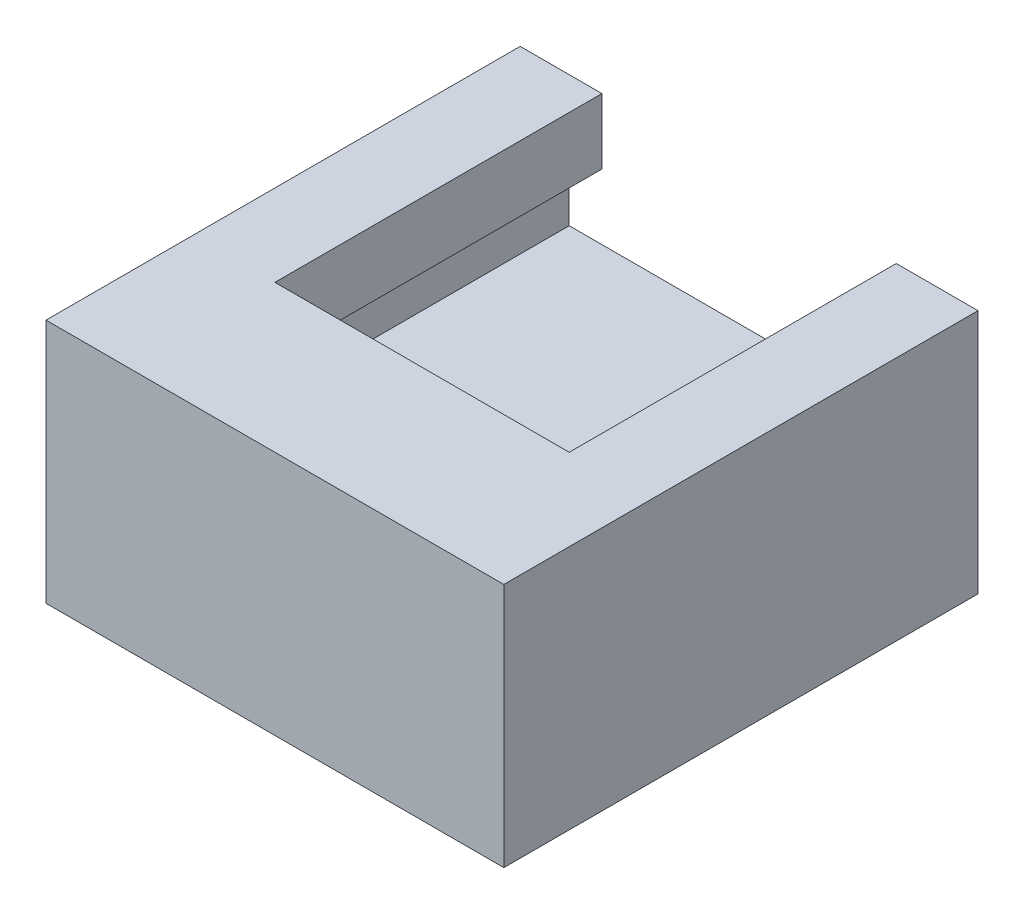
ISO-10303-21;
HEADER;
FILE_DESCRIPTION(('STEP AP214'),'2;1');
FILE_NAME('part.step','',(''),(''),'','','');
FILE_SCHEMA(('AUTOMOTIVE_DESIGN { 1 0 10303 214 1 1 1 1 }'));
ENDSEC;
DATA;
#1=APPLICATION_CONTEXT('core data for automotive mechanical design processes');
#2=APPLICATION_PROTOCOL_DEFINITION('international standard','automotive_design',2000,#1);
#3=PRODUCT_CONTEXT('',#1,'mechanical');
#4=PRODUCT('Part','Part','',(#3));
#5=PRODUCT_RELATED_PRODUCT_CATEGORY('part','',(#4));
#6=PRODUCT_DEFINITION_FORMATION('','',#4);
#7=PRODUCT_DEFINITION_CONTEXT('part definition',#1,'design');
#8=PRODUCT_DEFINITION('design','',#6,#7);
#9=PRODUCT_DEFINITION_SHAPE('','',#8);
#10=(LENGTH_UNIT() NAMED_UNIT(*) SI_UNIT(.MILLI.,.METRE.));
#11=(NAMED_UNIT(*) PLANE_ANGLE_UNIT() SI_UNIT($,.RADIAN.));
#12=(NAMED_UNIT(*) SI_UNIT($,.STERADIAN.) SOLID_ANGLE_UNIT());
#13=UNCERTAINTY_MEASURE_WITH_UNIT(LENGTH_MEASURE(1.E-05),#10,'distance_accuracy_value','');
#14=(GEOMETRIC_REPRESENTATION_CONTEXT(3) GLOBAL_UNCERTAINTY_ASSIGNED_CONTEXT((#13)) GLOBAL_UNIT_ASSIGNED_CONTEXT((#10,
#11,#12)) REPRESENTATION_CONTEXT('',''));
#15=CARTESIAN_POINT('',(0.,0.,0.));
#16=DIRECTION('',(0.,0.,1.));
#17=DIRECTION('',(1.,0.,0.));
#18=AXIS2_PLACEMENT_3D('',#15,#16,#17);
#19=CARTESIAN_POINT('',(0.,3.5,0.));
#20=DIRECTION('',(1.,0.,0.));
#21=DIRECTION('',(0.,0.,-1.));
#22=AXIS2_PLACEMENT_3D('',#19,#20,#21);
#23=PLANE('',#22);
#24=DIRECTION('',(0.,0.,1.));
#25=VECTOR('',#24,1.);
#26=CARTESIAN_POINT('',(0.,0.,0.));
#27=LINE('',#26,#25);
#28=CARTESIAN_POINT('',(0.,0.,-10.));
#29=VERTEX_POINT('',#28);
#30=CARTESIAN_POINT('',(0.,0.,4.5));
#31=VERTEX_POINT('',#30);
#32=EDGE_CURVE('E151',#29,#31,#27,.T.);
#33=ORIENTED_EDGE('',*,*,#32,.T.);
#34=DIRECTION('',(0.,-1.,0.));
#35=VECTOR('',#34,1.);
#36=CARTESIAN_POINT('',(0.,7.5,4.5));
#37=LINE('',#36,#35);
#38=CARTESIAN_POINT('',(0.,7.5,4.5));
#39=VERTEX_POINT('',#38);
#40=EDGE_CURVE('E161',#39,#31,#37,.T.);
#41=ORIENTED_EDGE('',*,*,#40,.F.);
#42=DIRECTION('',(0.,0.,1.));
#43=VECTOR('',#42,1.);
#44=CARTESIAN_POINT('',(0.,7.5,-14.7169905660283));
#45=LINE('',#44,#43);
#46=CARTESIAN_POINT('',(0.,7.5,-10.));
#47=VERTEX_POINT('',#46);
#48=EDGE_CURVE('E211',#47,#39,#45,.T.);
#49=ORIENTED_EDGE('',*,*,#48,.F.);
#50=DIRECTION('',(0.,-1.,0.));
#51=VECTOR('',#50,1.);
#52=CARTESIAN_POINT('',(0.,3.5,-10.));
#53=LINE('',#52,#51);
#54=EDGE_CURVE('E48',#47,#29,#53,.T.);
#55=ORIENTED_EDGE('',*,*,#54,.T.);
#56=EDGE_LOOP('',(#33,#41,#49,#55));
#57=FACE_BOUND('',#56,.T.);
#58=ADVANCED_FACE('F41',(#57),#23,.F.);
#59=CARTESIAN_POINT('',(14.,3.5,0.));
#60=DIRECTION('',(-1.,0.,0.));
#61=DIRECTION('',(0.,0.,1.));
#62=AXIS2_PLACEMENT_3D('',#59,#60,#61);
#63=PLANE('',#62);
#64=DIRECTION('',(0.,0.,-1.));
#65=VECTOR('',#64,1.);
#66=CARTESIAN_POINT('',(14.,0.,0.));
#67=LINE('',#66,#65);
#68=CARTESIAN_POINT('',(14.,0.,4.5));
#69=VERTEX_POINT('',#68);
#70=CARTESIAN_POINT('',(14.,0.,-10.));
#71=VERTEX_POINT('',#70);
#72=EDGE_CURVE('E143',#69,#71,#67,.T.);
#73=ORIENTED_EDGE('',*,*,#72,.T.);
#74=DIRECTION('',(0.,-1.,0.));
#75=VECTOR('',#74,1.);
#76=CARTESIAN_POINT('',(14.,3.5,-10.));
#77=LINE('',#76,#75);
#78=CARTESIAN_POINT('',(14.,7.5,-10.));
#79=VERTEX_POINT('',#78);
#80=EDGE_CURVE('E11',#79,#71,#77,.T.);
#81=ORIENTED_EDGE('',*,*,#80,.F.);
#82=DIRECTION('',(0.,0.,1.));
#83=VECTOR('',#82,1.);
#84=CARTESIAN_POINT('',(14.,7.5,-14.7169905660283));
#85=LINE('',#84,#83);
#86=CARTESIAN_POINT('',(14.,7.5,4.5));
#87=VERTEX_POINT('',#86);
#88=EDGE_CURVE('E166',#79,#87,#85,.T.);
#89=ORIENTED_EDGE('',*,*,#88,.T.);
#90=DIRECTION('',(0.,-1.,0.));
#91=VECTOR('',#90,1.);
#92=CARTESIAN_POINT('',(14.,7.5,4.5));
#93=LINE('',#92,#91);
#94=EDGE_CURVE('E158',#87,#69,#93,.T.);
#95=ORIENTED_EDGE('',*,*,#94,.T.);
#96=EDGE_LOOP('',(#73,#81,#89,#95));
#97=FACE_BOUND('',#96,.T.);
#98=ADVANCED_FACE('F164',(#97),#63,.F.);
#99=CARTESIAN_POINT('',(0.,3.5,-10.));
#100=DIRECTION('',(0.,0.,1.));
#101=DIRECTION('',(1.,0.,0.));
#102=AXIS2_PLACEMENT_3D('',#99,#100,#101);
#103=PLANE('',#102);
#104=DIRECTION('',(-1.,0.,0.));
#105=VECTOR('',#104,1.);
#106=CARTESIAN_POINT('',(0.,0.,-10.));
#107=LINE('',#106,#105);
#108=EDGE_CURVE('E148',#71,#29,#107,.T.);
#109=ORIENTED_EDGE('',*,*,#108,.T.);
#110=ORIENTED_EDGE('',*,*,#54,.F.);
#111=DIRECTION('',(1.,0.,0.));
#112=VECTOR('',#111,1.);
#113=CARTESIAN_POINT('',(0.,7.5,-10.));
#114=LINE('',#113,#112);
#115=CARTESIAN_POINT('',(2.5,7.5,-10.));
#116=VERTEX_POINT('',#115);
#117=EDGE_CURVE('E215',#47,#116,#114,.T.);
#118=ORIENTED_EDGE('',*,*,#117,.T.);
#119=DIRECTION('',(0.,-1.,0.));
#120=VECTOR('',#119,1.);
#121=CARTESIAN_POINT('',(2.5,7.5,-10.));
#122=LINE('',#121,#120);
#123=CARTESIAN_POINT('',(2.5,5.5,-10.));
#124=VERTEX_POINT('',#123);
#125=EDGE_CURVE('E213',#116,#124,#122,.T.);
#126=ORIENTED_EDGE('',*,*,#125,.T.);
#127=DIRECTION('',(-1.,0.,0.));
#128=VECTOR('',#127,1.);
#129=CARTESIAN_POINT('',(2.5,5.5,-10.));
#130=LINE('',#129,#128);
#131=CARTESIAN_POINT('',(2.,5.5,-10.));
#132=VERTEX_POINT('',#131);
#133=EDGE_CURVE('E210',#124,#132,#130,.T.);
#134=ORIENTED_EDGE('',*,*,#133,.T.);
#135=DIRECTION('',(-0.707106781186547,-0.707106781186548,0.));
#136=VECTOR('',#135,1.);
#137=CARTESIAN_POINT('',(2.,5.5,-10.));
#138=LINE('',#137,#136);
#139=CARTESIAN_POINT('',(1.5,5.,-10.));
#140=VERTEX_POINT('',#139);
#141=EDGE_CURVE('E208',#132,#140,#138,.T.);
#142=ORIENTED_EDGE('',*,*,#141,.T.);
#143=DIRECTION('',(0.,-1.,0.));
#144=VECTOR('',#143,1.);
#145=CARTESIAN_POINT('',(1.5,5.,-10.));
#146=LINE('',#145,#144);
#147=CARTESIAN_POINT('',(1.5,3.5,-10.));
#148=VERTEX_POINT('',#147);
#149=EDGE_CURVE('E217',#140,#148,#146,.T.);
#150=ORIENTED_EDGE('',*,*,#149,.T.);
#151=DIRECTION('',(-1.,0.,0.));
#152=VECTOR('',#151,1.);
#153=CARTESIAN_POINT('',(0.,3.5,-10.));
#154=LINE('',#153,#152);
#155=CARTESIAN_POINT('',(12.5,3.5,-10.));
#156=VERTEX_POINT('',#155);
#157=EDGE_CURVE('E242',#156,#148,#154,.T.);
#158=ORIENTED_EDGE('',*,*,#157,.F.);
#159=DIRECTION('',(0.,1.,0.));
#160=VECTOR('',#159,1.);
#161=CARTESIAN_POINT('',(12.5,5.,-10.));
#162=LINE('',#161,#160);
#163=CARTESIAN_POINT('',(12.5,5.,-10.));
#164=VERTEX_POINT('',#163);
#165=EDGE_CURVE('E172',#156,#164,#162,.T.);
#166=ORIENTED_EDGE('',*,*,#165,.T.);
#167=DIRECTION('',(-0.707106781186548,0.707106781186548,0.));
#168=VECTOR('',#167,1.);
#169=CARTESIAN_POINT('',(12.,5.5,-10.));
#170=LINE('',#169,#168);
#171=CARTESIAN_POINT('',(12.,5.5,-10.));
#172=VERTEX_POINT('',#171);
#173=EDGE_CURVE('E200',#164,#172,#170,.T.);
#174=ORIENTED_EDGE('',*,*,#173,.T.);
#175=DIRECTION('',(-1.,0.,0.));
#176=VECTOR('',#175,1.);
#177=CARTESIAN_POINT('',(11.5,5.5,-10.));
#178=LINE('',#177,#176);
#179=CARTESIAN_POINT('',(11.5,5.5,-10.));
#180=VERTEX_POINT('',#179);
#181=EDGE_CURVE('E202',#172,#180,#178,.T.);
#182=ORIENTED_EDGE('',*,*,#181,.T.);
#183=DIRECTION('',(0.,1.,0.));
#184=VECTOR('',#183,1.);
#185=CARTESIAN_POINT('',(11.5,7.5,-10.));
#186=LINE('',#185,#184);
#187=CARTESIAN_POINT('',(11.5,7.5,-10.));
#188=VERTEX_POINT('',#187);
#189=EDGE_CURVE('E204',#180,#188,#186,.T.);
#190=ORIENTED_EDGE('',*,*,#189,.T.);
#191=DIRECTION('',(1.,0.,0.));
#192=VECTOR('',#191,1.);
#193=CARTESIAN_POINT('',(14.,7.5,-10.));
#194=LINE('',#193,#192);
#195=EDGE_CURVE('E187',#188,#79,#194,.T.);
#196=ORIENTED_EDGE('',*,*,#195,.T.);
#197=ORIENTED_EDGE('',*,*,#80,.T.);
#198=EDGE_LOOP('',(#109,#110,#118,#126,#134,#142,#150,#158,#166,#174,#182,#190,#196,#197));
#199=FACE_BOUND('',#198,.T.);
#200=ADVANCED_FACE('F250',(#199),#103,.F.);
#201=CARTESIAN_POINT('',(0.,3.5,0.));
#202=DIRECTION('',(0.,-1.,0.));
#203=DIRECTION('',(0.,0.,-1.));
#204=AXIS2_PLACEMENT_3D('',#201,#202,#203);
#205=PLANE('',#204);
#206=DIRECTION('',(1.,0.,0.));
#207=VECTOR('',#206,1.);
#208=CARTESIAN_POINT('',(0.,3.5,0.));
#209=LINE('',#208,#207);
#210=CARTESIAN_POINT('',(1.5,3.5,0.));
#211=VERTEX_POINT('',#210);
#212=CARTESIAN_POINT('',(12.5,3.5,0.));
#213=VERTEX_POINT('',#212);
#214=EDGE_CURVE('E55',#211,#213,#209,.T.);
#215=ORIENTED_EDGE('',*,*,#214,.T.);
#216=DIRECTION('',(0.,0.,1.));
#217=VECTOR('',#216,1.);
#218=CARTESIAN_POINT('',(12.5,3.5,-14.7169905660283));
#219=LINE('',#218,#217);
#220=EDGE_CURVE('E185',#156,#213,#219,.T.);
#221=ORIENTED_EDGE('',*,*,#220,.F.);
#222=ORIENTED_EDGE('',*,*,#157,.T.);
#223=DIRECTION('',(0.,0.,1.));
#224=VECTOR('',#223,1.);
#225=CARTESIAN_POINT('',(1.5,3.5,-14.7169905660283));
#226=LINE('',#225,#224);
#227=EDGE_CURVE('E228',#148,#211,#226,.T.);
#228=ORIENTED_EDGE('',*,*,#227,.T.);
#229=EDGE_LOOP('',(#215,#221,#222,#228));
#230=FACE_BOUND('',#229,.T.);
#231=ADVANCED_FACE('F276',(#230),#205,.F.);
#232=CARTESIAN_POINT('',(0.,0.,0.));
#233=DIRECTION('',(0.,-1.,0.));
#234=DIRECTION('',(0.,0.,-1.));
#235=AXIS2_PLACEMENT_3D('',#232,#233,#234);
#236=PLANE('',#235);
#237=ORIENTED_EDGE('',*,*,#32,.F.);
#238=ORIENTED_EDGE('',*,*,#108,.F.);
#239=ORIENTED_EDGE('',*,*,#72,.F.);
#240=DIRECTION('',(1.,0.,0.));
#241=VECTOR('',#240,1.);
#242=CARTESIAN_POINT('',(0.,0.,4.5));
#243=LINE('',#242,#241);
#244=EDGE_CURVE('E147',#31,#69,#243,.T.);
#245=ORIENTED_EDGE('',*,*,#244,.F.);
#246=EDGE_LOOP('',(#237,#238,#239,#245));
#247=FACE_BOUND('',#246,.T.);
#248=ADVANCED_FACE('F146',(#247),#236,.T.);
#249=CARTESIAN_POINT('',(0.,7.5,-14.7169905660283));
#250=DIRECTION('',(0.,1.,0.));
#251=DIRECTION('',(0.,0.,1.));
#252=AXIS2_PLACEMENT_3D('',#249,#250,#251);
#253=PLANE('',#252);
#254=ORIENTED_EDGE('',*,*,#117,.F.);
#255=ORIENTED_EDGE('',*,*,#48,.T.);
#256=DIRECTION('',(1.,0.,0.));
#257=VECTOR('',#256,1.);
#258=CARTESIAN_POINT('',(0.,7.5,4.5));
#259=LINE('',#258,#257);
#260=EDGE_CURVE('E167',#39,#87,#259,.T.);
#261=ORIENTED_EDGE('',*,*,#260,.T.);
#262=ORIENTED_EDGE('',*,*,#88,.F.);
#263=ORIENTED_EDGE('',*,*,#195,.F.);
#264=DIRECTION('',(0.,0.,1.));
#265=VECTOR('',#264,1.);
#266=CARTESIAN_POINT('',(11.5,7.5,-14.7169905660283));
#267=LINE('',#266,#265);
#268=CARTESIAN_POINT('',(11.5,7.5,0.));
#269=VERTEX_POINT('',#268);
#270=EDGE_CURVE('E177',#188,#269,#267,.T.);
#271=ORIENTED_EDGE('',*,*,#270,.T.);
#272=DIRECTION('',(1.,0.,0.));
#273=VECTOR('',#272,1.);
#274=CARTESIAN_POINT('',(0.,7.5,0.));
#275=LINE('',#274,#273);
#276=CARTESIAN_POINT('',(2.5,7.5,0.));
#277=VERTEX_POINT('',#276);
#278=EDGE_CURVE('E162',#277,#269,#275,.T.);
#279=ORIENTED_EDGE('',*,*,#278,.F.);
#280=DIRECTION('',(0.,0.,1.));
#281=VECTOR('',#280,1.);
#282=CARTESIAN_POINT('',(2.5,7.5,-14.7169905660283));
#283=LINE('',#282,#281);
#284=EDGE_CURVE('E230',#116,#277,#283,.T.);
#285=ORIENTED_EDGE('',*,*,#284,.F.);
#286=EDGE_LOOP('',(#254,#255,#261,#262,#263,#271,#279,#285));
#287=FACE_BOUND('',#286,.T.);
#288=ADVANCED_FACE('F254',(#287),#253,.T.);
#289=CARTESIAN_POINT('',(2.5,7.5,-14.7169905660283));
#290=DIRECTION('',(1.,0.,0.));
#291=DIRECTION('',(0.,1.,0.));
#292=AXIS2_PLACEMENT_3D('',#289,#290,#291);
#293=PLANE('',#292);
#294=ORIENTED_EDGE('',*,*,#125,.F.);
#295=ORIENTED_EDGE('',*,*,#284,.T.);
#296=DIRECTION('',(0.,1.,0.));
#297=VECTOR('',#296,1.);
#298=CARTESIAN_POINT('',(2.5,7.5,0.));
#299=LINE('',#298,#297);
#300=CARTESIAN_POINT('',(2.5,5.5,0.));
#301=VERTEX_POINT('',#300);
#302=EDGE_CURVE('E225',#301,#277,#299,.T.);
#303=ORIENTED_EDGE('',*,*,#302,.F.);
#304=DIRECTION('',(0.,0.,1.));
#305=VECTOR('',#304,1.);
#306=CARTESIAN_POINT('',(2.5,5.5,-14.7169905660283));
#307=LINE('',#306,#305);
#308=EDGE_CURVE('E232',#124,#301,#307,.T.);
#309=ORIENTED_EDGE('',*,*,#308,.F.);
#310=EDGE_LOOP('',(#294,#295,#303,#309));
#311=FACE_BOUND('',#310,.T.);
#312=ADVANCED_FACE('F258',(#311),#293,.T.);
#313=CARTESIAN_POINT('',(2.5,5.5,-14.7169905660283));
#314=DIRECTION('',(0.,-1.,0.));
#315=DIRECTION('',(1.,0.,0.));
#316=AXIS2_PLACEMENT_3D('',#313,#314,#315);
#317=PLANE('',#316);
#318=ORIENTED_EDGE('',*,*,#133,.F.);
#319=ORIENTED_EDGE('',*,*,#308,.T.);
#320=DIRECTION('',(1.,0.,0.));
#321=VECTOR('',#320,1.);
#322=CARTESIAN_POINT('',(2.5,5.5,0.));
#323=LINE('',#322,#321);
#324=CARTESIAN_POINT('',(2.,5.5,0.));
#325=VERTEX_POINT('',#324);
#326=EDGE_CURVE('E222',#325,#301,#323,.T.);
#327=ORIENTED_EDGE('',*,*,#326,.F.);
#328=DIRECTION('',(0.,0.,1.));
#329=VECTOR('',#328,1.);
#330=CARTESIAN_POINT('',(2.,5.5,-14.7169905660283));
#331=LINE('',#330,#329);
#332=EDGE_CURVE('E234',#132,#325,#331,.T.);
#333=ORIENTED_EDGE('',*,*,#332,.F.);
#334=EDGE_LOOP('',(#318,#319,#327,#333));
#335=FACE_BOUND('',#334,.T.);
#336=ADVANCED_FACE('F267',(#335),#317,.T.);
#337=CARTESIAN_POINT('',(2.,5.5,-14.7169905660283));
#338=DIRECTION('',(0.707106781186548,-0.707106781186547,0.));
#339=DIRECTION('',(0.707106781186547,0.707106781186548,0.));
#340=AXIS2_PLACEMENT_3D('',#337,#338,#339);
#341=PLANE('',#340);
#342=ORIENTED_EDGE('',*,*,#141,.F.);
#343=ORIENTED_EDGE('',*,*,#332,.T.);
#344=DIRECTION('',(0.707106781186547,0.707106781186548,0.));
#345=VECTOR('',#344,1.);
#346=CARTESIAN_POINT('',(2.,5.5,0.));
#347=LINE('',#346,#345);
#348=CARTESIAN_POINT('',(1.5,5.,0.));
#349=VERTEX_POINT('',#348);
#350=EDGE_CURVE('E219',#349,#325,#347,.T.);
#351=ORIENTED_EDGE('',*,*,#350,.F.);
#352=DIRECTION('',(0.,0.,1.));
#353=VECTOR('',#352,1.);
#354=CARTESIAN_POINT('',(1.5,5.,-14.7169905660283));
#355=LINE('',#354,#353);
#356=EDGE_CURVE('E236',#140,#349,#355,.T.);
#357=ORIENTED_EDGE('',*,*,#356,.F.);
#358=EDGE_LOOP('',(#342,#343,#351,#357));
#359=FACE_BOUND('',#358,.T.);
#360=ADVANCED_FACE('F271',(#359),#341,.T.);
#361=CARTESIAN_POINT('',(1.5,5.,-14.7169905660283));
#362=DIRECTION('',(1.,0.,0.));
#363=DIRECTION('',(0.,1.,0.));
#364=AXIS2_PLACEMENT_3D('',#361,#362,#363);
#365=PLANE('',#364);
#366=ORIENTED_EDGE('',*,*,#149,.F.);
#367=ORIENTED_EDGE('',*,*,#356,.T.);
#368=DIRECTION('',(0.,1.,0.));
#369=VECTOR('',#368,1.);
#370=CARTESIAN_POINT('',(1.5,5.,0.));
#371=LINE('',#370,#369);
#372=EDGE_CURVE('E63',#211,#349,#371,.T.);
#373=ORIENTED_EDGE('',*,*,#372,.F.);
#374=ORIENTED_EDGE('',*,*,#227,.F.);
#375=EDGE_LOOP('',(#366,#367,#373,#374));
#376=FACE_BOUND('',#375,.T.);
#377=ADVANCED_FACE('F273',(#376),#365,.T.);
#378=CARTESIAN_POINT('',(12.5,5.,-14.7169905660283));
#379=DIRECTION('',(-1.,0.,0.));
#380=DIRECTION('',(0.,-1.,0.));
#381=AXIS2_PLACEMENT_3D('',#378,#379,#380);
#382=PLANE('',#381);
#383=ORIENTED_EDGE('',*,*,#165,.F.);
#384=ORIENTED_EDGE('',*,*,#220,.T.);
#385=DIRECTION('',(0.,-1.,0.));
#386=VECTOR('',#385,1.);
#387=CARTESIAN_POINT('',(12.5,5.,0.));
#388=LINE('',#387,#386);
#389=CARTESIAN_POINT('',(12.5,5.,0.));
#390=VERTEX_POINT('',#389);
#391=EDGE_CURVE('E176',#390,#213,#388,.T.);
#392=ORIENTED_EDGE('',*,*,#391,.F.);
#393=DIRECTION('',(0.,0.,1.));
#394=VECTOR('',#393,1.);
#395=CARTESIAN_POINT('',(12.5,5.,-14.7169905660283));
#396=LINE('',#395,#394);
#397=EDGE_CURVE('E183',#164,#390,#396,.T.);
#398=ORIENTED_EDGE('',*,*,#397,.F.);
#399=EDGE_LOOP('',(#383,#384,#392,#398));
#400=FACE_BOUND('',#399,.T.);
#401=ADVANCED_FACE('F280',(#400),#382,.T.);
#402=CARTESIAN_POINT('',(12.,5.5,-14.7169905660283));
#403=DIRECTION('',(-0.707106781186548,-0.707106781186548,0.));
#404=DIRECTION('',(0.707106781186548,-0.707106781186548,0.));
#405=AXIS2_PLACEMENT_3D('',#402,#403,#404);
#406=PLANE('',#405);
#407=ORIENTED_EDGE('',*,*,#173,.F.);
#408=ORIENTED_EDGE('',*,*,#397,.T.);
#409=DIRECTION('',(0.707106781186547,-0.707106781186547,0.));
#410=VECTOR('',#409,1.);
#411=CARTESIAN_POINT('',(12.,5.5,0.));
#412=LINE('',#411,#410);
#413=CARTESIAN_POINT('',(12.,5.5,0.));
#414=VERTEX_POINT('',#413);
#415=EDGE_CURVE('E190',#414,#390,#412,.T.);
#416=ORIENTED_EDGE('',*,*,#415,.F.);
#417=DIRECTION('',(0.,0.,1.));
#418=VECTOR('',#417,1.);
#419=CARTESIAN_POINT('',(12.,5.5,-14.7169905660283));
#420=LINE('',#419,#418);
#421=EDGE_CURVE('E181',#172,#414,#420,.T.);
#422=ORIENTED_EDGE('',*,*,#421,.F.);
#423=EDGE_LOOP('',(#407,#408,#416,#422));
#424=FACE_BOUND('',#423,.T.);
#425=ADVANCED_FACE('F283',(#424),#406,.T.);
#426=CARTESIAN_POINT('',(11.5,5.5,-14.7169905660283));
#427=DIRECTION('',(0.,-1.,0.));
#428=DIRECTION('',(1.,0.,0.));
#429=AXIS2_PLACEMENT_3D('',#426,#427,#428);
#430=PLANE('',#429);
#431=ORIENTED_EDGE('',*,*,#181,.F.);
#432=ORIENTED_EDGE('',*,*,#421,.T.);
#433=DIRECTION('',(1.,0.,0.));
#434=VECTOR('',#433,1.);
#435=CARTESIAN_POINT('',(11.5,5.5,0.));
#436=LINE('',#435,#434);
#437=CARTESIAN_POINT('',(11.5,5.5,0.));
#438=VERTEX_POINT('',#437);
#439=EDGE_CURVE('E193',#438,#414,#436,.T.);
#440=ORIENTED_EDGE('',*,*,#439,.F.);
#441=DIRECTION('',(0.,0.,1.));
#442=VECTOR('',#441,1.);
#443=CARTESIAN_POINT('',(11.5,5.5,-14.7169905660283));
#444=LINE('',#443,#442);
#445=EDGE_CURVE('E179',#180,#438,#444,.T.);
#446=ORIENTED_EDGE('',*,*,#445,.F.);
#447=EDGE_LOOP('',(#431,#432,#440,#446));
#448=FACE_BOUND('',#447,.T.);
#449=ADVANCED_FACE('F289',(#448),#430,.T.);
#450=CARTESIAN_POINT('',(11.5,7.5,-14.7169905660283));
#451=DIRECTION('',(-1.,0.,0.));
#452=DIRECTION('',(0.,0.,1.));
#453=AXIS2_PLACEMENT_3D('',#450,#451,#452);
#454=PLANE('',#453);
#455=ORIENTED_EDGE('',*,*,#189,.F.);
#456=ORIENTED_EDGE('',*,*,#445,.T.);
#457=DIRECTION('',(0.,-1.,0.));
#458=VECTOR('',#457,1.);
#459=CARTESIAN_POINT('',(11.5,7.5,0.));
#460=LINE('',#459,#458);
#461=EDGE_CURVE('E196',#269,#438,#460,.T.);
#462=ORIENTED_EDGE('',*,*,#461,.F.);
#463=ORIENTED_EDGE('',*,*,#270,.F.);
#464=EDGE_LOOP('',(#455,#456,#462,#463));
#465=FACE_BOUND('',#464,.T.);
#466=ADVANCED_FACE('F293',(#465),#454,.T.);
#467=CARTESIAN_POINT('',(0.,0.,4.5));
#468=DIRECTION('',(0.,0.,-1.));
#469=DIRECTION('',(-1.,0.,0.));
#470=AXIS2_PLACEMENT_3D('',#467,#468,#469);
#471=PLANE('',#470);
#472=ORIENTED_EDGE('',*,*,#244,.T.);
#473=ORIENTED_EDGE('',*,*,#94,.F.);
#474=ORIENTED_EDGE('',*,*,#260,.F.);
#475=ORIENTED_EDGE('',*,*,#40,.T.);
#476=EDGE_LOOP('',(#472,#473,#474,#475));
#477=FACE_BOUND('',#476,.T.);
#478=ADVANCED_FACE('F156',(#477),#471,.F.);
#479=CARTESIAN_POINT('',(0.,0.,0.));
#480=DIRECTION('',(0.,0.,-1.));
#481=DIRECTION('',(-1.,0.,0.));
#482=AXIS2_PLACEMENT_3D('',#479,#480,#481);
#483=PLANE('',#482);
#484=ORIENTED_EDGE('',*,*,#278,.T.);
#485=ORIENTED_EDGE('',*,*,#461,.T.);
#486=ORIENTED_EDGE('',*,*,#439,.T.);
#487=ORIENTED_EDGE('',*,*,#415,.T.);
#488=ORIENTED_EDGE('',*,*,#391,.T.);
#489=ORIENTED_EDGE('',*,*,#214,.F.);
#490=ORIENTED_EDGE('',*,*,#372,.T.);
#491=ORIENTED_EDGE('',*,*,#350,.T.);
#492=ORIENTED_EDGE('',*,*,#326,.T.);
#493=ORIENTED_EDGE('',*,*,#302,.T.);
#494=EDGE_LOOP('',(#484,#485,#486,#487,#488,#489,#490,#491,#492,#493));
#495=FACE_BOUND('',#494,.T.);
#496=ADVANCED_FACE('F261',(#495),#483,.T.);
#497=CLOSED_SHELL('',(#58,#98,#200,#231,#248,#288,#312,#336,#360,#377,#401,#425,#449,#466,#478,#496));
#498=MANIFOLD_SOLID_BREP('B2',#497);
#499=ADVANCED_BREP_SHAPE_REPRESENTATION('',(#18,#498),#14);
#500=SHAPE_DEFINITION_REPRESENTATION(#9,#499);
ENDSEC;
END-ISO-10303-21;
